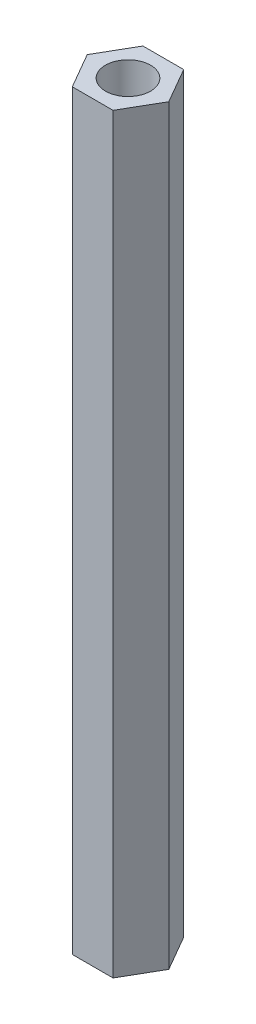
from build123d import *

# Parameters (mm, degrees)
SKETCH1_R           = 1.5
BOSS_EXTRUDE1_DEPTH = 50


with BuildPart() as part:
    # Sketch1 → Boss-Extrude1 (new body)
    with BuildSketch(Plane(origin=(0, 0, 0), x_dir=(1, 0, 0), z_dir=(0, 1, 0))):
        Polygon((1.356773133, -2.35), (2.713546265, 0), (1.356773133, 2.35), (-1.356773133, 2.35), (-2.713546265, 0), (-1.356773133, -2.35), align=None)
        with Locations(Location((0, 0, 0), (0, 0, 270))):
            Circle(SKETCH1_R, mode=Mode.SUBTRACT)
    extrude(amount=BOSS_EXTRUDE1_DEPTH)


solid = part.part
